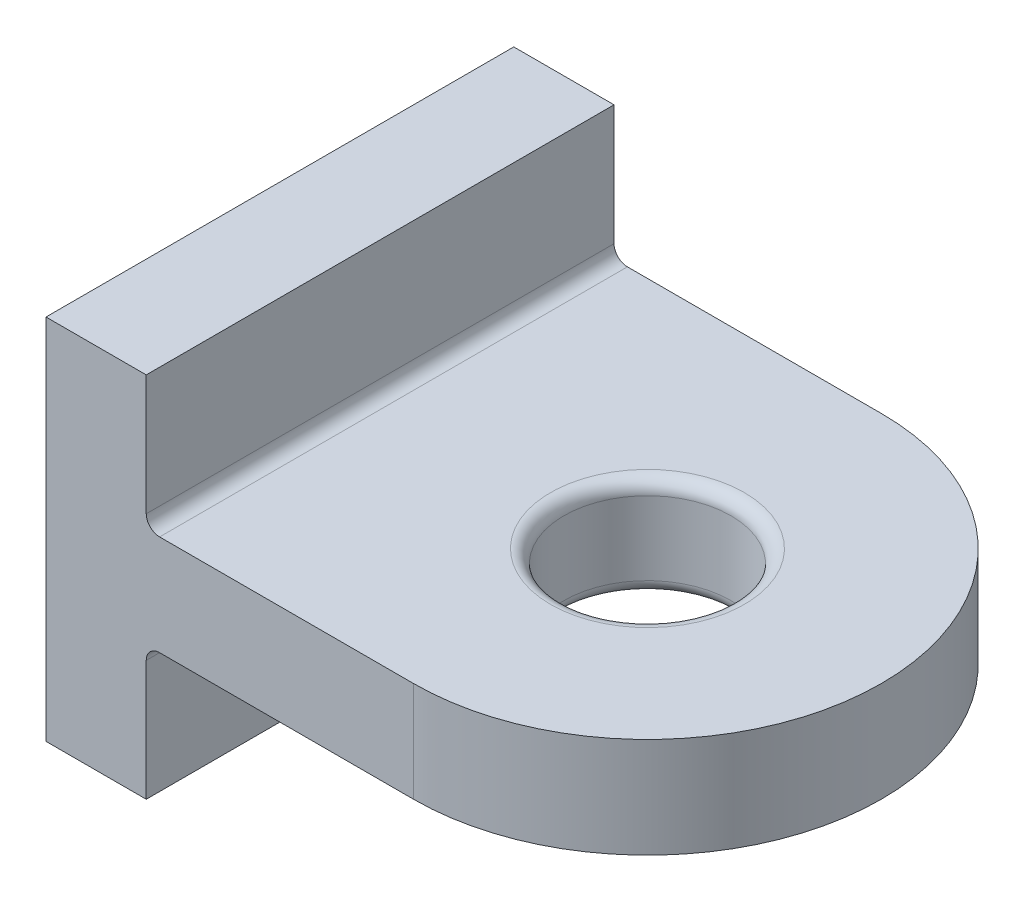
from build123d import *

# Parameters (mm, degrees)
SKETCH1_W          = 88.9
SKETCH1_H          = 44.45
EXTRUDE1_DEPTH     = 19.05
EXTRUDE2_DEPTH     = 19.05
SKETCH3_R          = 15.875
CUT_EXTRUDE1_DEPTH = 131.44575501
SKETCH4_W          = 88.9
SKETCH4_H          = 25.4
EXTRUDE3_DEPTH     = 19.05
FILLET1_R          = 2.54


with BuildPart() as part:
    # Sketch1 → Extrude1 (new body)
    with BuildSketch(Plane(origin=(0, 0, 0), x_dir=(0, 0, -1), z_dir=(1, 0, 0))):
        with Locations((0, -22.225)):
            Rectangle(SKETCH1_W, SKETCH1_H)
    extrude(amount=EXTRUDE1_DEPTH)

    # Sketch2 → Extrude2 (add)
    with BuildSketch(Plane(origin=(0, 0, 0), x_dir=(1, 0, 0), z_dir=(0, 1, 0))):
        with BuildLine():
            Line((19.05, 44.45), (69.85, 44.45))
            ThreePointArc((69.85, 44.45), (114.3, 0), (69.85, -44.45))
            Line((69.85, -44.45), (19.05, -44.45))
            Line((19.05, -44.45), (19.05, 44.45))
        make_face()
    extrude(amount=-EXTRUDE2_DEPTH)

    # Sketch3 → Cut-Extrude1 (cut, through all)
    with BuildSketch(Plane(origin=(0, 0, 0), x_dir=(1, 0, 0), z_dir=(0, 1, 0))):
        with Locations(Location((69.85, 0, 0), (0, 0, 270))):
            Circle(SKETCH3_R)
    extrude(amount=-CUT_EXTRUDE1_DEPTH, mode=Mode.SUBTRACT)

    # Sketch4 → Extrude3 (add)
    with BuildSketch(Plane.ZY):
        with Locations((0, 12.7)):
            Rectangle(SKETCH4_W, SKETCH4_H)
    extrude(amount=-EXTRUDE3_DEPTH)

    # Fillet1
    fillet1_edges = [part.edges().sort_by_distance(p)[0] for p in [
        (69.85, 0, -15.875),
        (69.85, -19.05, -15.875),
        (19.05, -19.05, 0),
        (19.05, 0, 0),
    ]]
    fillet(fillet1_edges, radius=FILLET1_R)


solid = part.part
